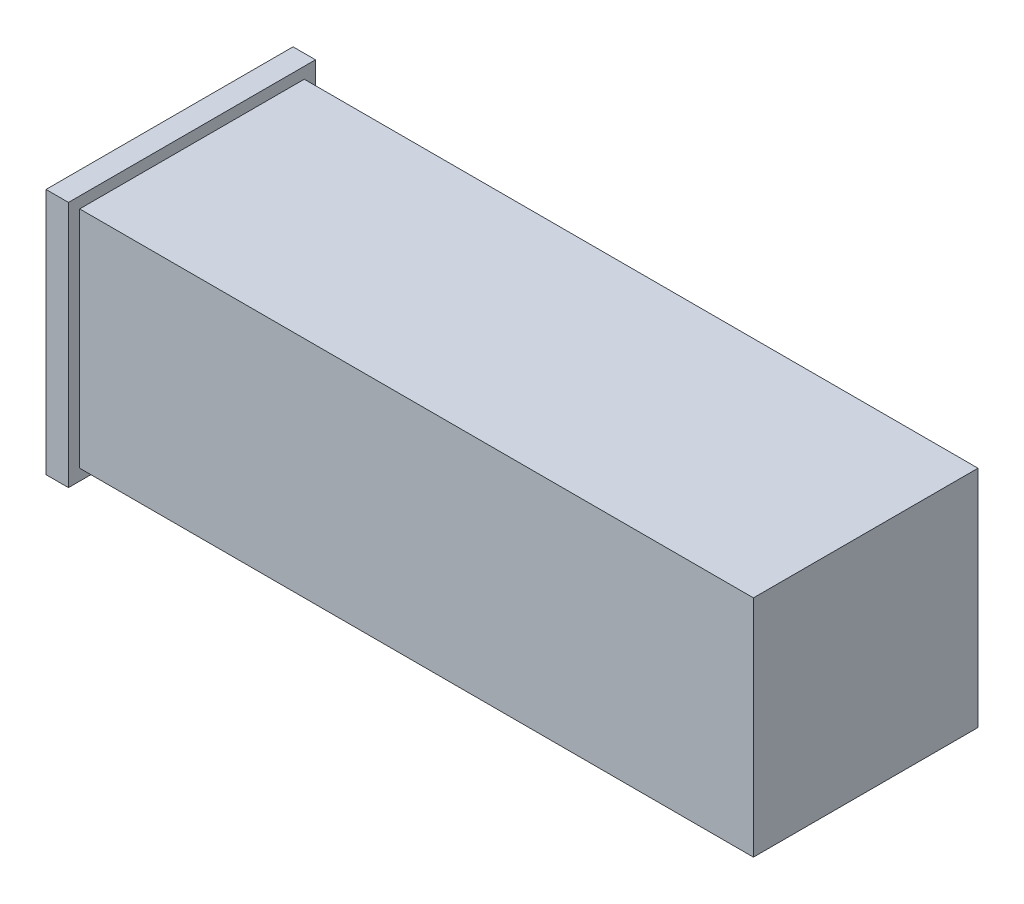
from build123d import *

# Parameters (mm, degrees)
SKETCH1_W           = 300
SKETCH1_H           = 100
BOSS_EXTRUDE1_DEPTH = 100
SKETCH2_W           = 110
SKETCH2_H           = 110
BOSS_EXTRUDE2_DEPTH = 10


with BuildPart() as part:
    # Sketch1 → Boss-Extrude1 (new body)
    with BuildSketch(Plane.XY):
        with Locations((150, 39.003436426)):
            Rectangle(SKETCH1_W, SKETCH1_H)
    extrude(amount=BOSS_EXTRUDE1_DEPTH)

    # Sketch2 → Boss-Extrude2 (add)
    with BuildSketch(Plane.ZY):
        with Locations((50, 39.003436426)):
            Rectangle(SKETCH2_W, SKETCH2_H)
    extrude(amount=BOSS_EXTRUDE2_DEPTH)


solid = part.part
